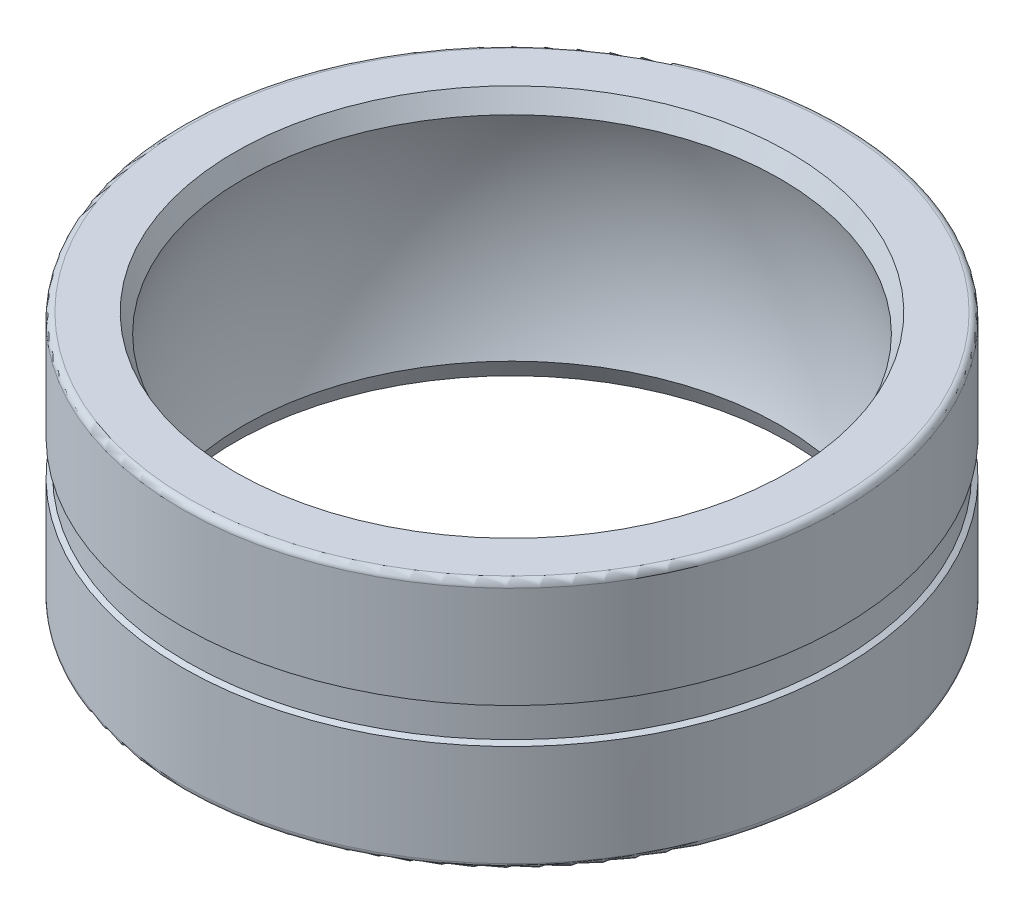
ISO-10303-21;
HEADER;
FILE_DESCRIPTION(('STEP AP214'),'2;1');
FILE_NAME('part.step','',(''),(''),'','','');
FILE_SCHEMA(('AUTOMOTIVE_DESIGN { 1 0 10303 214 1 1 1 1 }'));
ENDSEC;
DATA;
#1=APPLICATION_CONTEXT('core data for automotive mechanical design processes');
#2=APPLICATION_PROTOCOL_DEFINITION('international standard','automotive_design',2000,#1);
#3=PRODUCT_CONTEXT('',#1,'mechanical');
#4=PRODUCT('Part','Part','',(#3));
#5=PRODUCT_RELATED_PRODUCT_CATEGORY('part','',(#4));
#6=PRODUCT_DEFINITION_FORMATION('','',#4);
#7=PRODUCT_DEFINITION_CONTEXT('part definition',#1,'design');
#8=PRODUCT_DEFINITION('design','',#6,#7);
#9=PRODUCT_DEFINITION_SHAPE('','',#8);
#10=(LENGTH_UNIT() NAMED_UNIT(*) SI_UNIT(.MILLI.,.METRE.));
#11=(NAMED_UNIT(*) PLANE_ANGLE_UNIT() SI_UNIT($,.RADIAN.));
#12=(NAMED_UNIT(*) SI_UNIT($,.STERADIAN.) SOLID_ANGLE_UNIT());
#13=UNCERTAINTY_MEASURE_WITH_UNIT(LENGTH_MEASURE(1.E-05),#10,'distance_accuracy_value','');
#14=(GEOMETRIC_REPRESENTATION_CONTEXT(3) GLOBAL_UNCERTAINTY_ASSIGNED_CONTEXT((#13)) GLOBAL_UNIT_ASSIGNED_CONTEXT((#10,
#11,#12)) REPRESENTATION_CONTEXT('',''));
#15=CARTESIAN_POINT('',(0.,0.,0.));
#16=DIRECTION('',(0.,0.,1.));
#17=DIRECTION('',(1.,0.,0.));
#18=AXIS2_PLACEMENT_3D('',#15,#16,#17);
#19=CARTESIAN_POINT('',(0.,0.,0.));
#20=DIRECTION('',(0.,1.,0.));
#21=DIRECTION('',(0.,0.,1.));
#22=AXIS2_PLACEMENT_3D('',#19,#20,#21);
#23=CYLINDRICAL_SURFACE('',#22,51.765);
#24=CARTESIAN_POINT('',(0.,2.4,0.));
#25=DIRECTION('',(0.,1.,0.));
#26=DIRECTION('',(1.,0.,0.));
#27=AXIS2_PLACEMENT_3D('',#24,#25,#26);
#28=CIRCLE('',#27,51.765);
#29=CARTESIAN_POINT('',(51.765,2.4,0.));
#30=VERTEX_POINT('',#29);
#31=EDGE_CURVE('E222',#30,#30,#28,.T.);
#32=ORIENTED_EDGE('',*,*,#31,.F.);
#33=EDGE_LOOP('',(#32));
#34=FACE_BOUND('',#33,.T.);
#35=CARTESIAN_POINT('',(0.,-2.4,0.));
#36=DIRECTION('',(0.,-1.,0.));
#37=DIRECTION('',(1.,0.,0.));
#38=AXIS2_PLACEMENT_3D('',#35,#36,#37);
#39=CIRCLE('',#38,51.765);
#40=CARTESIAN_POINT('',(51.765,-2.4,0.));
#41=VERTEX_POINT('',#40);
#42=EDGE_CURVE('E225',#41,#41,#39,.T.);
#43=ORIENTED_EDGE('',*,*,#42,.F.);
#44=EDGE_LOOP('',(#43));
#45=FACE_BOUND('',#44,.T.);
#46=ADVANCED_FACE('F14',(#34,#45),#23,.T.);
#47=CARTESIAN_POINT('',(0.,-2.82435244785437,0.));
#48=DIRECTION('',(0.,-1.,0.));
#49=DIRECTION('',(0.,0.,-1.));
#50=AXIS2_PLACEMENT_3D('',#47,#48,#49);
#51=CONICAL_SURFACE('',#50,52.5,1.0471975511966);
#52=ORIENTED_EDGE('',*,*,#42,.T.);
#53=EDGE_LOOP('',(#52));
#54=FACE_BOUND('',#53,.T.);
#55=CARTESIAN_POINT('',(0.,-2.82435244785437,0.));
#56=DIRECTION('',(0.,1.,0.));
#57=DIRECTION('',(0.,0.,1.));
#58=AXIS2_PLACEMENT_3D('',#55,#56,#57);
#59=CIRCLE('',#58,52.5);
#60=CARTESIAN_POINT('',(0.,-2.82435244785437,52.5));
#61=VERTEX_POINT('',#60);
#62=EDGE_CURVE('E227',#61,#61,#59,.F.);
#63=ORIENTED_EDGE('',*,*,#62,.F.);
#64=EDGE_LOOP('',(#63));
#65=FACE_BOUND('',#64,.T.);
#66=ADVANCED_FACE('F194',(#54,#65),#51,.T.);
#67=CARTESIAN_POINT('',(0.,2.82435244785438,0.));
#68=DIRECTION('',(0.,1.,0.));
#69=DIRECTION('',(0.,0.,1.));
#70=AXIS2_PLACEMENT_3D('',#67,#68,#69);
#71=CONICAL_SURFACE('',#70,52.5,1.0471975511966);
#72=CARTESIAN_POINT('',(0.,2.82435244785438,0.));
#73=DIRECTION('',(0.,1.,0.));
#74=DIRECTION('',(0.,0.,1.));
#75=AXIS2_PLACEMENT_3D('',#72,#73,#74);
#76=CIRCLE('',#75,52.5);
#77=CARTESIAN_POINT('',(0.,2.82435244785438,52.5));
#78=VERTEX_POINT('',#77);
#79=EDGE_CURVE('E232',#78,#78,#76,.T.);
#80=ORIENTED_EDGE('',*,*,#79,.F.);
#81=EDGE_LOOP('',(#80));
#82=FACE_BOUND('',#81,.T.);
#83=ORIENTED_EDGE('',*,*,#31,.T.);
#84=EDGE_LOOP('',(#83));
#85=FACE_BOUND('',#84,.T.);
#86=ADVANCED_FACE('F185',(#82,#85),#71,.T.);
#87=CARTESIAN_POINT('',(0.,-10.9121762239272,0.));
#88=DIRECTION('',(0.,1.,0.));
#89=DIRECTION('',(0.,0.,1.));
#90=AXIS2_PLACEMENT_3D('',#87,#88,#89);
#91=CYLINDRICAL_SURFACE('',#90,52.5);
#92=ORIENTED_EDGE('',*,*,#62,.T.);
#93=EDGE_LOOP('',(#92));
#94=FACE_BOUND('',#93,.T.);
#95=CARTESIAN_POINT('',(0.,-19.,0.));
#96=DIRECTION('',(0.,1.,0.));
#97=DIRECTION('',(-1.,0.,0.));
#98=AXIS2_PLACEMENT_3D('',#95,#96,#97);
#99=CIRCLE('',#98,52.5);
#100=CARTESIAN_POINT('',(-52.5,-19.,0.));
#101=VERTEX_POINT('',#100);
#102=EDGE_CURVE('E66',#101,#101,#99,.F.);
#103=ORIENTED_EDGE('',*,*,#102,.F.);
#104=EDGE_LOOP('',(#103));
#105=FACE_BOUND('',#104,.T.);
#106=ADVANCED_FACE('F177',(#94,#105),#91,.T.);
#107=CARTESIAN_POINT('',(0.,10.9121762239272,0.));
#108=DIRECTION('',(0.,1.,0.));
#109=DIRECTION('',(0.,0.,1.));
#110=AXIS2_PLACEMENT_3D('',#107,#108,#109);
#111=CYLINDRICAL_SURFACE('',#110,52.5);
#112=CARTESIAN_POINT('',(0.,19.,0.));
#113=DIRECTION('',(0.,1.,0.));
#114=DIRECTION('',(-1.,0.,0.));
#115=AXIS2_PLACEMENT_3D('',#112,#113,#114);
#116=CIRCLE('',#115,52.5);
#117=CARTESIAN_POINT('',(-52.5,19.,0.));
#118=VERTEX_POINT('',#117);
#119=EDGE_CURVE('E67',#118,#118,#116,.T.);
#120=ORIENTED_EDGE('',*,*,#119,.F.);
#121=EDGE_LOOP('',(#120));
#122=FACE_BOUND('',#121,.T.);
#123=ORIENTED_EDGE('',*,*,#79,.T.);
#124=EDGE_LOOP('',(#123));
#125=FACE_BOUND('',#124,.T.);
#126=ADVANCED_FACE('F169',(#122,#125),#111,.T.);
#127=CARTESIAN_POINT('',(0.,-19.,0.));
#128=DIRECTION('',(0.,1.,0.));
#129=DIRECTION('',(-1.,0.,0.));
#130=AXIS2_PLACEMENT_3D('',#127,#128,#129);
#131=TOROIDAL_SURFACE('',#130,51.5,1.);
#132=CARTESIAN_POINT('',(0.,-20.,0.));
#133=DIRECTION('',(0.,1.,0.));
#134=DIRECTION('',(1.,0.,0.));
#135=AXIS2_PLACEMENT_3D('',#132,#133,#134);
#136=CIRCLE('',#135,51.5);
#137=CARTESIAN_POINT('',(51.5,-20.,0.));
#138=VERTEX_POINT('',#137);
#139=EDGE_CURVE('E70',#138,#138,#136,.F.);
#140=ORIENTED_EDGE('',*,*,#139,.F.);
#141=EDGE_LOOP('',(#140));
#142=FACE_BOUND('',#141,.T.);
#143=ORIENTED_EDGE('',*,*,#102,.T.);
#144=EDGE_LOOP('',(#143));
#145=FACE_BOUND('',#144,.T.);
#146=ADVANCED_FACE('F56',(#142,#145),#131,.T.);
#147=CARTESIAN_POINT('',(0.,19.,0.));
#148=DIRECTION('',(0.,1.,0.));
#149=DIRECTION('',(-1.,0.,0.));
#150=AXIS2_PLACEMENT_3D('',#147,#148,#149);
#151=TOROIDAL_SURFACE('',#150,51.5,1.00000000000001);
#152=ORIENTED_EDGE('',*,*,#119,.T.);
#153=EDGE_LOOP('',(#152));
#154=FACE_BOUND('',#153,.T.);
#155=CARTESIAN_POINT('',(0.,20.,0.));
#156=DIRECTION('',(0.,-1.,0.));
#157=DIRECTION('',(1.,0.,0.));
#158=AXIS2_PLACEMENT_3D('',#155,#156,#157);
#159=CIRCLE('',#158,51.5);
#160=CARTESIAN_POINT('',(51.5,20.,0.));
#161=VERTEX_POINT('',#160);
#162=EDGE_CURVE('E37',#161,#161,#159,.F.);
#163=ORIENTED_EDGE('',*,*,#162,.F.);
#164=EDGE_LOOP('',(#163));
#165=FACE_BOUND('',#164,.T.);
#166=ADVANCED_FACE('F44',(#154,#165),#151,.T.);
#167=CARTESIAN_POINT('',(47.821171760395,-20.,0.));
#168=DIRECTION('',(0.,-1.,0.));
#169=DIRECTION('',(0.,0.,-1.));
#170=AXIS2_PLACEMENT_3D('',#167,#168,#169);
#171=PLANE('',#170);
#172=CARTESIAN_POINT('',(0.,-20.,0.));
#173=DIRECTION('',(0.,-1.,0.));
#174=DIRECTION('',(0.,0.,-1.));
#175=AXIS2_PLACEMENT_3D('',#172,#173,#174);
#176=CIRCLE('',#175,44.14234352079);
#177=CARTESIAN_POINT('',(0.,-20.,-44.14234352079));
#178=VERTEX_POINT('',#177);
#179=EDGE_CURVE('E19',#178,#178,#176,.T.);
#180=ORIENTED_EDGE('',*,*,#179,.F.);
#181=EDGE_LOOP('',(#180));
#182=FACE_BOUND('',#181,.T.);
#183=ORIENTED_EDGE('',*,*,#139,.T.);
#184=EDGE_LOOP('',(#183));
#185=FACE_BOUND('',#184,.T.);
#186=ADVANCED_FACE('F55',(#182,#185),#171,.T.);
#187=CARTESIAN_POINT('',(47.821171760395,20.,0.));
#188=DIRECTION('',(0.,1.,0.));
#189=DIRECTION('',(0.,0.,1.));
#190=AXIS2_PLACEMENT_3D('',#187,#188,#189);
#191=PLANE('',#190);
#192=ORIENTED_EDGE('',*,*,#162,.T.);
#193=EDGE_LOOP('',(#192));
#194=FACE_BOUND('',#193,.T.);
#195=CARTESIAN_POINT('',(0.,20.,0.));
#196=DIRECTION('',(0.,1.,0.));
#197=DIRECTION('',(0.,0.,1.));
#198=AXIS2_PLACEMENT_3D('',#195,#196,#197);
#199=CIRCLE('',#198,44.14234352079);
#200=CARTESIAN_POINT('',(0.,20.,44.14234352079));
#201=VERTEX_POINT('',#200);
#202=EDGE_CURVE('E28',#201,#201,#199,.T.);
#203=ORIENTED_EDGE('',*,*,#202,.F.);
#204=EDGE_LOOP('',(#203));
#205=FACE_BOUND('',#204,.T.);
#206=ADVANCED_FACE('F85',(#194,#205),#191,.T.);
#207=CARTESIAN_POINT('',(0.,-17.,0.));
#208=DIRECTION('',(0.,-1.,0.));
#209=DIRECTION('',(0.,0.,-1.));
#210=AXIS2_PLACEMENT_3D('',#207,#208,#209);
#211=CONICAL_SURFACE('',#210,42.743420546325,0.436332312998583);
#212=ORIENTED_EDGE('',*,*,#179,.T.);
#213=EDGE_LOOP('',(#212));
#214=FACE_BOUND('',#213,.T.);
#215=CARTESIAN_POINT('',(0.,-17.,0.));
#216=DIRECTION('',(0.,1.,0.));
#217=DIRECTION('',(-1.,0.,0.));
#218=AXIS2_PLACEMENT_3D('',#215,#216,#217);
#219=CIRCLE('',#218,42.7434205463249);
#220=CARTESIAN_POINT('',(-42.7434205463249,-17.,0.));
#221=VERTEX_POINT('',#220);
#222=EDGE_CURVE('E23',#221,#221,#219,.F.);
#223=ORIENTED_EDGE('',*,*,#222,.F.);
#224=EDGE_LOOP('',(#223));
#225=FACE_BOUND('',#224,.T.);
#226=ADVANCED_FACE('F94',(#214,#225),#211,.F.);
#227=CARTESIAN_POINT('',(0.,17.,0.));
#228=DIRECTION('',(0.,1.,0.));
#229=DIRECTION('',(0.,0.,1.));
#230=AXIS2_PLACEMENT_3D('',#227,#228,#229);
#231=CONICAL_SURFACE('',#230,42.743420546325,0.436332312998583);
#232=CARTESIAN_POINT('',(0.,17.,0.));
#233=DIRECTION('',(0.,1.,0.));
#234=DIRECTION('',(-1.,0.,0.));
#235=AXIS2_PLACEMENT_3D('',#232,#233,#234);
#236=CIRCLE('',#235,42.743420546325);
#237=CARTESIAN_POINT('',(-42.743420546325,17.,0.));
#238=VERTEX_POINT('',#237);
#239=EDGE_CURVE('E10',#238,#238,#236,.T.);
#240=ORIENTED_EDGE('',*,*,#239,.F.);
#241=EDGE_LOOP('',(#240));
#242=FACE_BOUND('',#241,.T.);
#243=ORIENTED_EDGE('',*,*,#202,.T.);
#244=EDGE_LOOP('',(#243));
#245=FACE_BOUND('',#244,.T.);
#246=ADVANCED_FACE('F96',(#242,#245),#231,.F.);
#247=CARTESIAN_POINT('',(3.256579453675,0.,0.));
#248=DIRECTION('',(0.,0.,-1.));
#249=DIRECTION('',(-1.,0.,0.));
#250=AXIS2_PLACEMENT_3D('',#247,#248,#249);
#251=CIRCLE('',#250,49.0407993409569);
#252=TRIMMED_CURVE('',#251,(PARAMETER_VALUE(-1.50434191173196)),
(PARAMETER_VALUE(1.50434191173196)),.T.,.PARAMETER.);
#253=CARTESIAN_POINT('',(0.,0.,0.));
#254=DIRECTION('',(0.,1.,0.));
#255=AXIS1_PLACEMENT('',#253,#254);
#256=SURFACE_OF_REVOLUTION('',#252,#255);
#257=ORIENTED_EDGE('',*,*,#222,.T.);
#258=EDGE_LOOP('',(#257));
#259=FACE_BOUND('',#258,.T.);
#260=ORIENTED_EDGE('',*,*,#239,.T.);
#261=EDGE_LOOP('',(#260));
#262=FACE_BOUND('',#261,.T.);
#263=ADVANCED_FACE('F16',(#259,#262),#256,.F.);
#264=CLOSED_SHELL('',(#46,#66,#86,#106,#126,#146,#166,#186,#206,#226,#246,#263));
#265=MANIFOLD_SOLID_BREP('B1',#264);
#266=ADVANCED_BREP_SHAPE_REPRESENTATION('',(#18,#265),#14);
#267=SHAPE_DEFINITION_REPRESENTATION(#9,#266);
ENDSEC;
END-ISO-10303-21;
